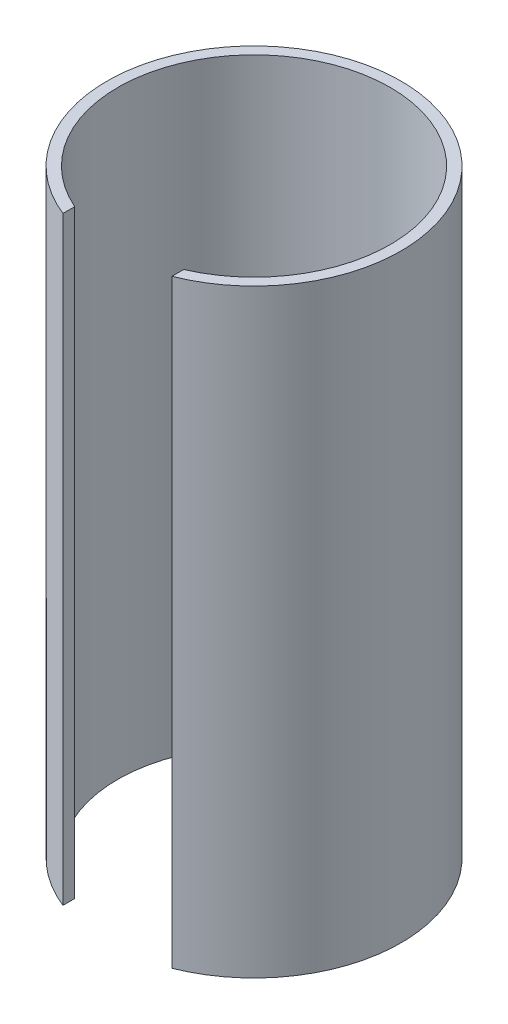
from build123d import *

# Parameters (mm, degrees)
EXTRUDE1_DEPTH = 55


with BuildPart() as part:
    # Sketch1 → Extrude1 (new body)
    with BuildSketch(Plane(origin=(0, 0, 0), x_dir=(1, 0, 0), z_dir=(0, 1, 0))):
        with BuildLine():
            Line((-5, -11.456439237), (-5, -12.539936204))
            ThreePointArc((-5, -12.539936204), (0, 13.5), (5, -12.539936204))
            Line((5, -12.539936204), (5, -11.456439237))
            ThreePointArc((5, -11.456439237), (0, 12.5), (-5, -11.456439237))
        make_face()
    extrude(amount=EXTRUDE1_DEPTH)


solid = part.part
